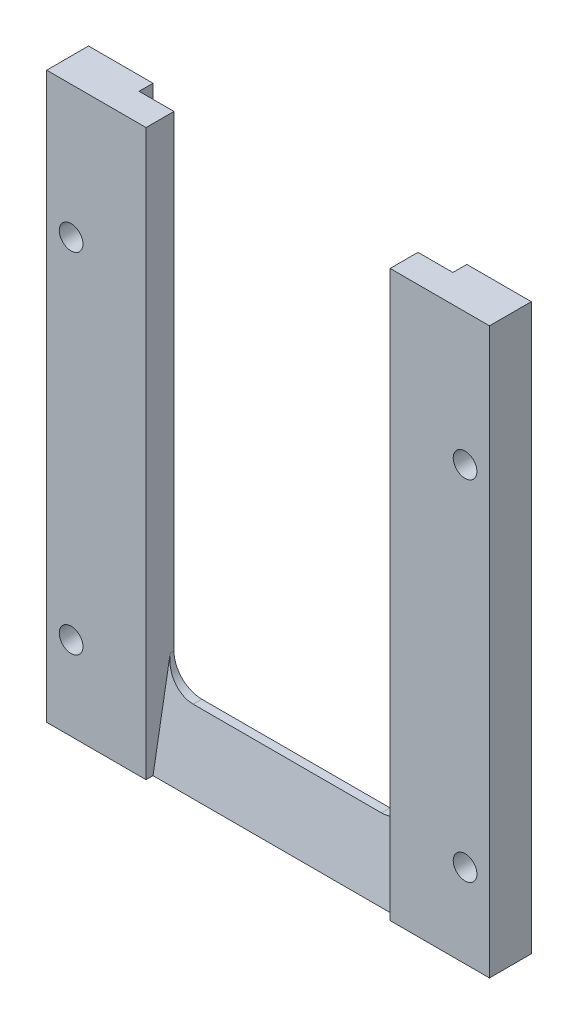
from build123d import *

# Parameters (mm, degrees)
BOSS_EXTRUDE1_DEPTH                             = 31.75
SKETCH3_W                                       = 35
SKETCH3_H                                       = 71
CUT_EXTRUDE1_DEPTH                              = 53.202131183
SKETCH4_W                                       = 45
SKETCH4_H                                       = 75.5
CUT_EXTRUDE2_DEPTH                              = 2
SKETCH10_R                                      = 1.5
CUT_EXTRUDE9_DEPTH                              = 2
CSK_FOR_M3_FLAT_HEAD_MACHINE_SCREW1_D           = 3.4
CSK_FOR_M3_FLAT_HEAD_MACHINE_SCREW1_CSINK_D     = 6.3
CSK_FOR_M3_FLAT_HEAD_MACHINE_SCREW1_CSINK_ANGLE = 90
FILLET5_R                                       = 4
CUT_EXTRUDE11_DEPTH                             = 17.5


with BuildPart() as part:
    # Sketch1 → Boss-Extrude1 (new, symmetric)
    with BuildSketch(Plane(origin=(0, 0, 0), x_dir=(0, 0, -1), z_dir=(1, 0, 0))):
        Polygon((0, 0), (0, 41), (6, 41), (6, -40), (0, -40), align=None)
    extrude(amount=BOSS_EXTRUDE1_DEPTH, both=True)

    # Sketch3 → Cut-Extrude1 (cut, through all)
    with BuildSketch(Plane(origin=(0, 0, -6), x_dir=(-1, 0, 0), z_dir=(0, 0, -1))):
        with Locations((0, 5.5)):
            Rectangle(SKETCH3_W, SKETCH3_H)
    extrude(amount=-CUT_EXTRUDE1_DEPTH, mode=Mode.SUBTRACT)

    # Sketch4 → Cut-Extrude2 (cut)
    with BuildSketch(Plane(origin=(0, 0, -6), x_dir=(-1, 0, 0), z_dir=(0, 0, -1))):
        with Locations((0, 3.25)):
            Rectangle(SKETCH4_W, SKETCH4_H)
    extrude(amount=-CUT_EXTRUDE2_DEPTH, mode=Mode.SUBTRACT)

    # Sketch10 → Cut-Extrude9 (cut)
    with BuildSketch(Plane(origin=(0, 0, -6), x_dir=(-1, 0, 0), z_dir=(0, 0, -1))):
        with Locations((-22.5, -34.5)):
            Circle(SKETCH10_R)
        with Locations((22.5, -34.5)):
            Circle(SKETCH10_R)
    extrude(amount=-CUT_EXTRUDE9_DEPTH, mode=Mode.SUBTRACT)

    # CSK for M3 Flat Head Machine Screw1 (through all)
    with Locations(Plane(origin=(0, 0, -6), x_dir=(-1, 0, 0), z_dir=(0, 0, -1))):
        with Locations((-28.25, -28), (-28.25, 22), (28.25, 22), (28.25, -28)):
            CounterSinkHole(CSK_FOR_M3_FLAT_HEAD_MACHINE_SCREW1_D / 2, CSK_FOR_M3_FLAT_HEAD_MACHINE_SCREW1_CSINK_D / 2, counter_sink_angle=CSK_FOR_M3_FLAT_HEAD_MACHINE_SCREW1_CSINK_ANGLE)

    # Fillet5
    fillet5_edges = [part.edges().sort_by_distance(p)[0] for p in [
        (-17.5, -30, -2),
        (17.5, -30, -2),
    ]]
    fillet(fillet5_edges, radius=FILLET5_R)

    # Sketch16 → Cut-Extrude11 (cut, symmetric)
    with BuildSketch(Plane(origin=(0, 0, 0), x_dir=(0, 0, -1), z_dir=(1, 0, 0))):
        Polygon((0, -40), (0, -25), (3.644904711, -25), (1, -40), align=None)
    extrude(amount=CUT_EXTRUDE11_DEPTH, both=True, mode=Mode.SUBTRACT)


solid = part.part
